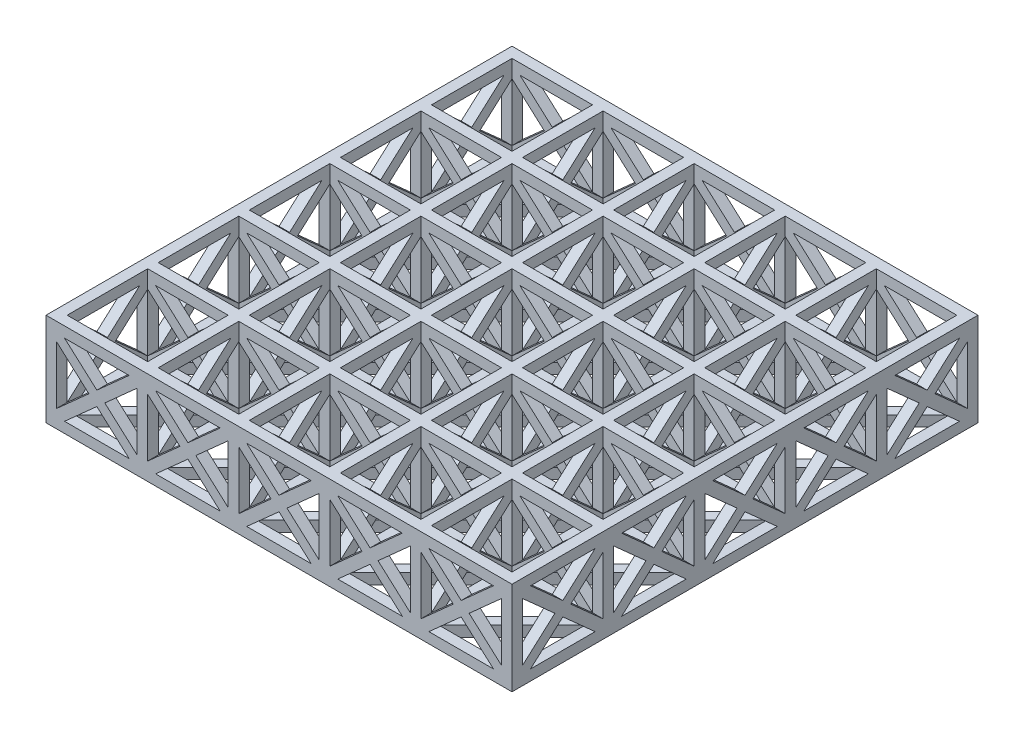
from build123d import *

# Parameters (mm, degrees)
SKETCH1_W           = 88
SKETCH1_H           = 88
BOSS_EXTRUDE1_DEPTH = 17.6
SKETCH2_W           = 15.2
SKETCH2_H           = 15.2
CUT_EXTRUDE1_DEPTH  = 15.6
CUT_EXTRUDE2_DEPTH  = 100.948786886
CUT_EXTRUDE3_DEPTH  = 100.948786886
CUT_EXTRUDE4_DEPTH  = 65.666529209


with BuildPart() as part:
    # Sketch1 → Boss-Extrude1 (new body)
    with BuildSketch(Plane(origin=(0, 0, 0), x_dir=(1, 0, 0), z_dir=(0, 1, 0))):
        Rectangle(SKETCH1_W, SKETCH1_H)
    extrude(amount=BOSS_EXTRUDE1_DEPTH)

    # Sketch2 → Cut-Extrude1 (cut)
    with BuildSketch(Plane(origin=(0, 17.6, 0), x_dir=(1, 0, 0), z_dir=(0, 1, 0))):
        with Locations((-34.4, 34.4)):
            Rectangle(SKETCH2_W, SKETCH2_H)
        with Locations((-17.2, 34.4)):
            Rectangle(SKETCH2_W, SKETCH2_H)
        with Locations((0, 34.4)):
            Rectangle(SKETCH2_W, SKETCH2_H)
        with Locations((17.2, 34.4)):
            Rectangle(SKETCH2_W, SKETCH2_H)
        with Locations((34.4, 34.4)):
            Rectangle(SKETCH2_W, SKETCH2_H)
        with Locations((-17.2, 17.2)):
            Rectangle(SKETCH2_W, SKETCH2_H)
        with Locations((0, 17.2)):
            Rectangle(SKETCH2_W, SKETCH2_H)
        with Locations((17.2, 17.2)):
            Rectangle(SKETCH2_W, SKETCH2_H)
        with Locations((34.4, 17.2)):
            Rectangle(SKETCH2_W, SKETCH2_H)
        with Locations((-17.2, 0)):
            Rectangle(SKETCH2_W, SKETCH2_H)
        Rectangle(SKETCH2_W, SKETCH2_H)
        with Locations((17.2, 0)):
            Rectangle(SKETCH2_W, SKETCH2_H)
        with Locations((34.4, 0)):
            Rectangle(SKETCH2_W, SKETCH2_H)
        with Locations((-17.2, -17.2)):
            Rectangle(SKETCH2_W, SKETCH2_H)
        with Locations((0, -17.2)):
            Rectangle(SKETCH2_W, SKETCH2_H)
        with Locations((17.2, -17.2)):
            Rectangle(SKETCH2_W, SKETCH2_H)
        with Locations((34.4, -17.2)):
            Rectangle(SKETCH2_W, SKETCH2_H)
        with Locations((-17.2, -34.4)):
            Rectangle(SKETCH2_W, SKETCH2_H)
        with Locations((0, -34.4)):
            Rectangle(SKETCH2_W, SKETCH2_H)
        with Locations((17.2, -34.4)):
            Rectangle(SKETCH2_W, SKETCH2_H)
        with Locations((34.4, -34.4)):
            Rectangle(SKETCH2_W, SKETCH2_H)
        with Locations((-34.4, 17.2)):
            Rectangle(SKETCH2_W, SKETCH2_H)
        with Locations((-34.4, 0)):
            Rectangle(SKETCH2_W, SKETCH2_H)
        with Locations((-34.4, -17.2)):
            Rectangle(SKETCH2_W, SKETCH2_H)
        with Locations((-34.4, -34.4)):
            Rectangle(SKETCH2_W, SKETCH2_H)
    extrude(amount=-CUT_EXTRUDE1_DEPTH, mode=Mode.SUBTRACT)

    # Sketch3 → Cut-Extrude2 (cut, through all)
    with BuildSketch(Plane.XY.offset(44)):
        Polygon((-40.500288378, 2), (-28.299711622, 2), (-34.4, 7.45815276), align=None)
        Polygon((-42, 3.34184724), (-42, 14.25815276), (-35.899711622, 8.8), align=None)
        Polygon((-40.500288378, 15.6), (-28.299711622, 15.6), (-34.4, 10.14184724), align=None)
        Polygon((-26.8, 3.34184724), (-26.8, 14.25815276), (-32.900288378, 8.8), align=None)
        Polygon((-23.300288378, 2), (-11.099711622, 2), (-17.2, 7.45815276), align=None)
        Polygon((-24.8, 3.34184724), (-24.8, 14.25815276), (-18.699711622, 8.8), align=None)
        Polygon((-23.300288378, 15.6), (-11.099711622, 15.6), (-17.2, 10.14184724), align=None)
        Polygon((-9.6, 3.34184724), (-9.6, 14.25815276), (-15.700288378, 8.8), align=None)
        Polygon((-6.100288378, 2), (6.100288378, 2), (0, 7.45815276), align=None)
        Polygon((-7.6, 3.34184724), (-7.6, 14.25815276), (-1.499711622, 8.8), align=None)
        Polygon((-6.100288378, 15.6), (6.100288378, 15.6), (0, 10.14184724), align=None)
        Polygon((7.6, 3.34184724), (7.6, 14.25815276), (1.499711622, 8.8), align=None)
        Polygon((11.099711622, 2), (23.300288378, 2), (17.2, 7.45815276), align=None)
        Polygon((9.6, 3.34184724), (9.6, 14.25815276), (15.700288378, 8.8), align=None)
        Polygon((11.099711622, 15.6), (23.300288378, 15.6), (17.2, 10.14184724), align=None)
        Polygon((24.8, 3.34184724), (24.8, 14.25815276), (18.699711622, 8.8), align=None)
        Polygon((28.299711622, 2), (40.500288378, 2), (34.4, 7.45815276), align=None)
        Polygon((26.8, 3.34184724), (26.8, 14.25815276), (32.900288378, 8.8), align=None)
        Polygon((28.299711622, 15.6), (40.500288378, 15.6), (34.4, 10.14184724), align=None)
        Polygon((42, 3.34184724), (42, 14.25815276), (35.899711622, 8.8), align=None)
    extrude(amount=-CUT_EXTRUDE2_DEPTH, mode=Mode.SUBTRACT)

    # Sketch4 → Cut-Extrude3 (cut, through all)
    with BuildSketch(Plane(origin=(44, 0, 0), x_dir=(0, 0, -1), z_dir=(1, 0, 0))):
        Polygon((-40.500288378, 2), (-28.299711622, 2), (-34.4, 7.45815276), align=None)
        Polygon((-42, 3.34184724), (-42, 14.25815276), (-35.899711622, 8.8), align=None)
        Polygon((-40.500288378, 15.6), (-28.299711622, 15.6), (-34.4, 10.14184724), align=None)
        Polygon((-26.8, 3.34184724), (-26.8, 14.25815276), (-32.900288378, 8.8), align=None)
        Polygon((-23.300288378, 15.6), (-11.099711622, 15.6), (-17.2, 10.14184724), align=None)
        Polygon((-24.8, 3.34184724), (-24.8, 14.25815276), (-18.699711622, 8.8), align=None)
        Polygon((-23.300288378, 2), (-11.099711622, 2), (-17.2, 7.45815276), align=None)
        Polygon((-9.6, 3.34184724), (-9.6, 14.25815276), (-15.700288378, 8.8), align=None)
        Polygon((-6.100288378, 15.6), (6.100288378, 15.6), (0, 10.14184724), align=None)
        Polygon((-7.6, 3.34184724), (-7.6, 14.25815276), (-1.499711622, 8.8), align=None)
        Polygon((-6.100288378, 2), (6.100288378, 2), (0, 7.45815276), align=None)
        Polygon((7.6, 3.34184724), (7.6, 14.25815276), (1.499711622, 8.8), align=None)
        Polygon((11.099711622, 15.6), (23.300288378, 15.6), (17.2, 10.14184724), align=None)
        Polygon((9.6, 3.34184724), (9.6, 14.25815276), (15.700288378, 8.8), align=None)
        Polygon((11.099711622, 2), (23.300288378, 2), (17.2, 7.45815276), align=None)
        Polygon((24.8, 3.34184724), (24.8, 14.25815276), (18.699711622, 8.8), align=None)
        Polygon((28.299711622, 15.6), (40.500288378, 15.6), (34.4, 10.14184724), align=None)
        Polygon((26.8, 3.34184724), (26.8, 14.25815276), (32.900288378, 8.8), align=None)
        Polygon((28.299711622, 2), (40.500288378, 2), (34.4, 7.45815276), align=None)
        Polygon((42, 3.34184724), (42, 14.25815276), (35.899711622, 8.8), align=None)
    extrude(amount=-CUT_EXTRUDE3_DEPTH, mode=Mode.SUBTRACT)

    # Sketch5 → Cut-Extrude4 (cut, through all)
    with BuildSketch(Plane.XZ):
        Polygon((-40.585786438, 42), (-28.214213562, 42), (-34.4, 35.814213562), align=None)
        Polygon((-42, 40.585786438), (-42, 28.214213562), (-35.814213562, 34.4), align=None)
        Polygon((-40.585786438, 26.8), (-28.214213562, 26.8), (-34.4, 32.985786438), align=None)
        Polygon((-26.8, 40.585786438), (-26.8, 28.214213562), (-32.985786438, 34.4), align=None)
        Polygon((-23.385786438, 42), (-11.014213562, 42), (-17.2, 35.814213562), align=None)
        Polygon((-24.8, 40.585786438), (-24.8, 28.214213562), (-18.614213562, 34.4), align=None)
        Polygon((-23.385786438, 26.8), (-11.014213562, 26.8), (-17.2, 32.985786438), align=None)
        Polygon((-9.6, 40.585786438), (-9.6, 28.214213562), (-15.785786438, 34.4), align=None)
        Polygon((-6.185786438, 42), (6.185786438, 42), (0, 35.814213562), align=None)
        Polygon((-7.6, 40.585786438), (-7.6, 28.214213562), (-1.414213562, 34.4), align=None)
        Polygon((-6.185786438, 26.8), (6.185786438, 26.8), (0, 32.985786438), align=None)
        Polygon((7.6, 40.585786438), (7.6, 28.214213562), (1.414213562, 34.4), align=None)
        Polygon((11.014213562, 42), (23.385786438, 42), (17.2, 35.814213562), align=None)
        Polygon((9.6, 40.585786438), (9.6, 28.214213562), (15.785786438, 34.4), align=None)
        Polygon((11.014213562, 26.8), (23.385786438, 26.8), (17.2, 32.985786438), align=None)
        Polygon((24.8, 40.585786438), (24.8, 28.214213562), (18.614213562, 34.4), align=None)
        Polygon((28.214213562, 42), (40.585786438, 42), (34.4, 35.814213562), align=None)
        Polygon((26.8, 40.585786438), (26.8, 28.214213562), (32.985786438, 34.4), align=None)
        Polygon((28.214213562, 26.8), (40.585786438, 26.8), (34.4, 32.985786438), align=None)
        Polygon((42, 40.585786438), (42, 28.214213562), (35.814213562, 34.4), align=None)
        Polygon((-23.385786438, 24.8), (-11.014213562, 24.8), (-17.2, 18.614213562), align=None)
        Polygon((-24.8, 23.385786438), (-24.8, 11.014213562), (-18.614213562, 17.2), align=None)
        Polygon((-23.385786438, 9.6), (-11.014213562, 9.6), (-17.2, 15.785786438), align=None)
        Polygon((-9.6, 23.385786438), (-9.6, 11.014213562), (-15.785786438, 17.2), align=None)
        Polygon((-6.185786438, 24.8), (6.185786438, 24.8), (0, 18.614213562), align=None)
        Polygon((-7.6, 23.385786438), (-7.6, 11.014213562), (-1.414213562, 17.2), align=None)
        Polygon((-6.185786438, 9.6), (6.185786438, 9.6), (0, 15.785786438), align=None)
        Polygon((7.6, 23.385786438), (7.6, 11.014213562), (1.414213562, 17.2), align=None)
        Polygon((11.014213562, 24.8), (23.385786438, 24.8), (17.2, 18.614213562), align=None)
        Polygon((9.6, 23.385786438), (9.6, 11.014213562), (15.785786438, 17.2), align=None)
        Polygon((11.014213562, 9.6), (23.385786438, 9.6), (17.2, 15.785786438), align=None)
        Polygon((24.8, 23.385786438), (24.8, 11.014213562), (18.614213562, 17.2), align=None)
        Polygon((28.214213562, 24.8), (40.585786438, 24.8), (34.4, 18.614213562), align=None)
        Polygon((26.8, 23.385786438), (26.8, 11.014213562), (32.985786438, 17.2), align=None)
        Polygon((28.214213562, 9.6), (40.585786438, 9.6), (34.4, 15.785786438), align=None)
        Polygon((42, 23.385786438), (42, 11.014213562), (35.814213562, 17.2), align=None)
        Polygon((-23.385786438, 7.6), (-11.014213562, 7.6), (-17.2, 1.414213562), align=None)
        Polygon((-24.8, 6.185786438), (-24.8, -6.185786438), (-18.614213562, 0), align=None)
        Polygon((-23.385786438, -7.6), (-11.014213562, -7.6), (-17.2, -1.414213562), align=None)
        Polygon((-9.6, 6.185786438), (-9.6, -6.185786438), (-15.785786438, 0), align=None)
        Polygon((-6.185786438, 7.6), (6.185786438, 7.6), (0, 1.414213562), align=None)
        Polygon((-7.6, 6.185786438), (-7.6, -6.185786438), (-1.414213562, 0), align=None)
        Polygon((-6.185786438, -7.6), (6.185786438, -7.6), (0, -1.414213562), align=None)
        Polygon((7.6, 6.185786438), (7.6, -6.185786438), (1.414213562, 0), align=None)
        Polygon((11.014213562, 7.6), (23.385786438, 7.6), (17.2, 1.414213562), align=None)
        Polygon((9.6, 6.185786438), (9.6, -6.185786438), (15.785786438, 0), align=None)
        Polygon((11.014213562, -7.6), (23.385786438, -7.6), (17.2, -1.414213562), align=None)
        Polygon((24.8, 6.185786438), (24.8, -6.185786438), (18.614213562, 0), align=None)
        Polygon((28.214213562, 7.6), (40.585786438, 7.6), (34.4, 1.414213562), align=None)
        Polygon((26.8, 6.185786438), (26.8, -6.185786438), (32.985786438, 0), align=None)
        Polygon((28.214213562, -7.6), (40.585786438, -7.6), (34.4, -1.414213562), align=None)
        Polygon((42, 6.185786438), (42, -6.185786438), (35.814213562, 0), align=None)
        Polygon((-23.385786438, -9.6), (-11.014213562, -9.6), (-17.2, -15.785786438), align=None)
        Polygon((-24.8, -11.014213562), (-24.8, -23.385786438), (-18.614213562, -17.2), align=None)
        Polygon((-23.385786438, -24.8), (-11.014213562, -24.8), (-17.2, -18.614213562), align=None)
        Polygon((-9.6, -11.014213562), (-9.6, -23.385786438), (-15.785786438, -17.2), align=None)
        Polygon((-6.185786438, -9.6), (6.185786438, -9.6), (0, -15.785786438), align=None)
        Polygon((-7.6, -11.014213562), (-7.6, -23.385786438), (-1.414213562, -17.2), align=None)
        Polygon((-6.185786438, -24.8), (6.185786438, -24.8), (0, -18.614213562), align=None)
        Polygon((7.6, -11.014213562), (7.6, -23.385786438), (1.414213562, -17.2), align=None)
        Polygon((11.014213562, -9.6), (23.385786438, -9.6), (17.2, -15.785786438), align=None)
        Polygon((9.6, -11.014213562), (9.6, -23.385786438), (15.785786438, -17.2), align=None)
        Polygon((11.014213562, -24.8), (23.385786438, -24.8), (17.2, -18.614213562), align=None)
        Polygon((24.8, -11.014213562), (24.8, -23.385786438), (18.614213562, -17.2), align=None)
        Polygon((28.214213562, -9.6), (40.585786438, -9.6), (34.4, -15.785786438), align=None)
        Polygon((26.8, -11.014213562), (26.8, -23.385786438), (32.985786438, -17.2), align=None)
        Polygon((28.214213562, -24.8), (40.585786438, -24.8), (34.4, -18.614213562), align=None)
        Polygon((42, -11.014213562), (42, -23.385786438), (35.814213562, -17.2), align=None)
        Polygon((-23.385786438, -26.8), (-11.014213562, -26.8), (-17.2, -32.985786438), align=None)
        Polygon((-24.8, -28.214213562), (-24.8, -40.585786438), (-18.614213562, -34.4), align=None)
        Polygon((-23.385786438, -42), (-11.014213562, -42), (-17.2, -35.814213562), align=None)
        Polygon((-9.6, -28.214213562), (-9.6, -40.585786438), (-15.785786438, -34.4), align=None)
        Polygon((-6.185786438, -26.8), (6.185786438, -26.8), (0, -32.985786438), align=None)
        Polygon((-7.6, -28.214213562), (-7.6, -40.585786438), (-1.414213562, -34.4), align=None)
        Polygon((-6.185786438, -42), (6.185786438, -42), (0, -35.814213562), align=None)
        Polygon((7.6, -28.214213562), (7.6, -40.585786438), (1.414213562, -34.4), align=None)
        Polygon((11.014213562, -26.8), (23.385786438, -26.8), (17.2, -32.985786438), align=None)
        Polygon((9.6, -28.214213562), (9.6, -40.585786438), (15.785786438, -34.4), align=None)
        Polygon((11.014213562, -42), (23.385786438, -42), (17.2, -35.814213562), align=None)
        Polygon((24.8, -28.214213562), (24.8, -40.585786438), (18.614213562, -34.4), align=None)
        Polygon((28.214213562, -26.8), (40.585786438, -26.8), (34.4, -32.985786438), align=None)
        Polygon((26.8, -28.214213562), (26.8, -40.585786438), (32.985786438, -34.4), align=None)
        Polygon((28.214213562, -42), (40.585786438, -42), (34.4, -35.814213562), align=None)
        Polygon((42, -28.214213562), (42, -40.585786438), (35.814213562, -34.4), align=None)
        Polygon((-40.585786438, 24.8), (-28.214213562, 24.8), (-34.4, 18.614213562), align=None)
        Polygon((-42, 23.385786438), (-42, 11.014213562), (-35.814213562, 17.2), align=None)
        Polygon((-40.585786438, 9.6), (-28.214213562, 9.6), (-34.4, 15.785786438), align=None)
        Polygon((-26.8, 23.385786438), (-26.8, 11.014213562), (-32.985786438, 17.2), align=None)
        Polygon((-40.585786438, 7.6), (-28.214213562, 7.6), (-34.4, 1.414213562), align=None)
        Polygon((-42, 6.185786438), (-42, -6.185786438), (-35.814213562, 0), align=None)
        Polygon((-40.585786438, -7.6), (-28.214213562, -7.6), (-34.4, -1.414213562), align=None)
        Polygon((-26.8, 6.185786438), (-26.8, -6.185786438), (-32.985786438, 0), align=None)
        Polygon((-40.585786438, -9.6), (-28.214213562, -9.6), (-34.4, -15.785786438), align=None)
        Polygon((-42, -11.014213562), (-42, -23.385786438), (-35.814213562, -17.2), align=None)
        Polygon((-40.585786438, -24.8), (-28.214213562, -24.8), (-34.4, -18.614213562), align=None)
        Polygon((-26.8, -11.014213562), (-26.8, -23.385786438), (-32.985786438, -17.2), align=None)
        Polygon((-40.585786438, -26.8), (-28.214213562, -26.8), (-34.4, -32.985786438), align=None)
        Polygon((-42, -28.214213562), (-42, -40.585786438), (-35.814213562, -34.4), align=None)
        Polygon((-40.585786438, -42), (-28.214213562, -42), (-34.4, -35.814213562), align=None)
        Polygon((-26.8, -28.214213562), (-26.8, -40.585786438), (-32.985786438, -34.4), align=None)
    extrude(amount=-CUT_EXTRUDE4_DEPTH, mode=Mode.SUBTRACT)


solid = part.part
